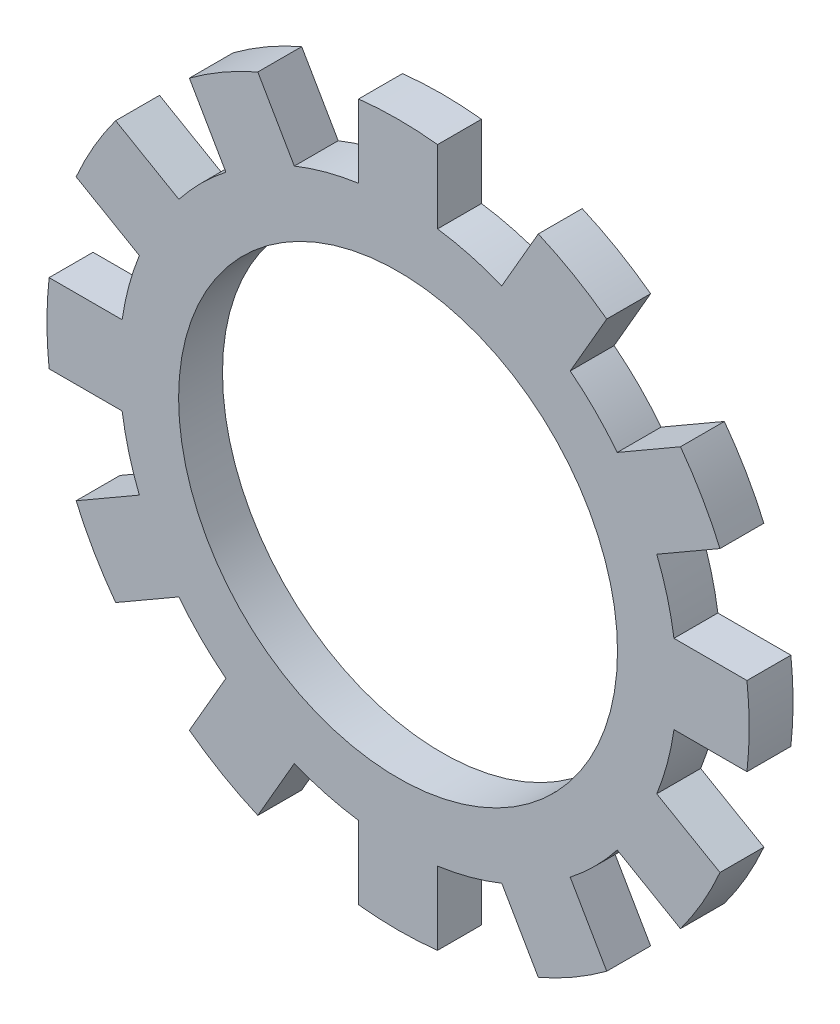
from build123d import *

# Parameters (mm, degrees)
SKETCH1_R                 = 3.175
SKETCH1_R_2               = 2.5
BOSS_EXTRUDE1_DEPTH       = 0.25
BOSS_EXTRUDE2_DEPTH       = 0.25
CIRPATTERN2_COUNT         = 12
CIRPATTERN2_COPY_1_DEPTH  = 0.25
CIRPATTERN2_COPY_2_DEPTH  = 0.25
CIRPATTERN2_COPY_3_DEPTH  = 0.25
CIRPATTERN2_COPY_4_DEPTH  = 0.25
CIRPATTERN2_COPY_5_DEPTH  = 0.25
CIRPATTERN2_COPY_6_DEPTH  = 0.25
CIRPATTERN2_COPY_7_DEPTH  = 0.25
CIRPATTERN2_COPY_8_DEPTH  = 0.25
CIRPATTERN2_COPY_9_DEPTH  = 0.25
CIRPATTERN2_COPY_10_DEPTH = 0.25
CIRPATTERN2_COPY_11_DEPTH = 0.25


with BuildPart() as part:
    # Sketch1 → Boss-Extrude1 (new, symmetric)
    with BuildSketch(Plane.XY):
        Circle(SKETCH1_R)
        Circle(SKETCH1_R_2, mode=Mode.SUBTRACT)
    extrude(amount=BOSS_EXTRUDE1_DEPTH, both=True)

    # Sketch3 → Boss-Extrude2 (add, symmetric)
    with BuildSketch(Plane.XY):
        with BuildLine():
            Line((-0.45, 3.974606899), (-0.45, 3.142948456))
            ThreePointArc((-0.45, 3.142948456), (-0.225570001, 3.166976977), (0, 3.175))
            Line((0, 3.175), (0, 4))
            ThreePointArc((0, 4), (-0.225357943, 3.993646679), (-0.45, 3.974606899))
        make_face()
    boss_extrude2 = extrude(amount=BOSS_EXTRUDE2_DEPTH, both=True)

    # Mirror1: Boss-Extrude2 across plane
    add(boss_extrude2.mirror(Plane(origin=(0, 0, 0), x_dir=(0, 0, 1), z_dir=(1, 0, 0))))

    # CirPattern2: Boss-Extrude2 ×12 about axis
    cirpattern2_axis = Axis((0, 0, 0), (0, 0, 1))
    for i in range(1, CIRPATTERN2_COUNT):
        add(boss_extrude2.rotate(cirpattern2_axis, i * 360 / CIRPATTERN2_COUNT))

    # CirPattern2 copy 1 sketch → CirPattern2 copy 1 (add, symmetric)
    with BuildSketch(Plane(origin=(0, 0, 0), x_dir=(-0.8660254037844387, -0.49999999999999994, 0), z_dir=(0, 0, 1))):
        with BuildLine():
            Line((-0.45, -3.974606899), (-0.45, -3.142948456))
            ThreePointArc((-0.45, -3.142948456), (-0.225570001, -3.166976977), (0, -3.175))
            Line((0, -3.175), (0, -4))
            ThreePointArc((0, -4), (-0.225357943, -3.993646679), (-0.45, -3.974606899))
        make_face()
    extrude(amount=CIRPATTERN2_COPY_1_DEPTH, both=True)

    # CirPattern2 copy 2 sketch → CirPattern2 copy 2 (add, symmetric)
    with BuildSketch(Plane(origin=(0, 0, 0), x_dir=(-0.5000000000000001, -0.8660254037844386, 0), z_dir=(0, 0, 1))):
        with BuildLine():
            Line((-0.45, -3.974606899), (-0.45, -3.142948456))
            ThreePointArc((-0.45, -3.142948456), (-0.225570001, -3.166976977), (0, -3.175))
            Line((0, -3.175), (0, -4))
            ThreePointArc((0, -4), (-0.225357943, -3.993646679), (-0.45, -3.974606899))
        make_face()
    extrude(amount=CIRPATTERN2_COPY_2_DEPTH, both=True)

    # CirPattern2 copy 3 sketch → CirPattern2 copy 3 (add, symmetric)
    with BuildSketch(Plane(origin=(0, 0, 0), x_dir=(0, -1, 0), z_dir=(0, 0, 1))):
        with BuildLine():
            Line((-0.45, -3.974606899), (-0.45, -3.142948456))
            ThreePointArc((-0.45, -3.142948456), (-0.225570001, -3.166976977), (0, -3.175))
            Line((0, -3.175), (0, -4))
            ThreePointArc((0, -4), (-0.225357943, -3.993646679), (-0.45, -3.974606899))
        make_face()
    extrude(amount=CIRPATTERN2_COPY_3_DEPTH, both=True)

    # CirPattern2 copy 4 sketch → CirPattern2 copy 4 (add, symmetric)
    with BuildSketch(Plane(origin=(0, 0, 0), x_dir=(0.4999999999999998, -0.8660254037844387, 0), z_dir=(0, 0, 1))):
        with BuildLine():
            Line((-0.45, -3.974606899), (-0.45, -3.142948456))
            ThreePointArc((-0.45, -3.142948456), (-0.225570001, -3.166976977), (0, -3.175))
            Line((0, -3.175), (0, -4))
            ThreePointArc((0, -4), (-0.225357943, -3.993646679), (-0.45, -3.974606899))
        make_face()
    extrude(amount=CIRPATTERN2_COPY_4_DEPTH, both=True)

    # CirPattern2 copy 5 sketch → CirPattern2 copy 5 (add, symmetric)
    with BuildSketch(Plane(origin=(0, 0, 0), x_dir=(0.8660254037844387, -0.49999999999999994, 0), z_dir=(0, 0, 1))):
        with BuildLine():
            Line((-0.45, -3.974606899), (-0.45, -3.142948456))
            ThreePointArc((-0.45, -3.142948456), (-0.225570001, -3.166976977), (0, -3.175))
            Line((0, -3.175), (0, -4))
            ThreePointArc((0, -4), (-0.225357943, -3.993646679), (-0.45, -3.974606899))
        make_face()
    extrude(amount=CIRPATTERN2_COPY_5_DEPTH, both=True)

    # CirPattern2 copy 6 sketch → CirPattern2 copy 6 (add, symmetric)
    with BuildSketch(Plane.XY):
        with BuildLine():
            Line((-0.45, -3.974606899), (-0.45, -3.142948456))
            ThreePointArc((-0.45, -3.142948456), (-0.225570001, -3.166976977), (0, -3.175))
            Line((0, -3.175), (0, -4))
            ThreePointArc((0, -4), (-0.225357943, -3.993646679), (-0.45, -3.974606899))
        make_face()
    extrude(amount=CIRPATTERN2_COPY_6_DEPTH, both=True)

    # CirPattern2 copy 7 sketch → CirPattern2 copy 7 (add, symmetric)
    with BuildSketch(Plane(origin=(0, 0, 0), x_dir=(0.8660254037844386, 0.5000000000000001, 0), z_dir=(0, 0, 1))):
        with BuildLine():
            Line((-0.45, -3.974606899), (-0.45, -3.142948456))
            ThreePointArc((-0.45, -3.142948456), (-0.225570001, -3.166976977), (0, -3.175))
            Line((0, -3.175), (0, -4))
            ThreePointArc((0, -4), (-0.225357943, -3.993646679), (-0.45, -3.974606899))
        make_face()
    extrude(amount=CIRPATTERN2_COPY_7_DEPTH, both=True)

    # CirPattern2 copy 8 sketch → CirPattern2 copy 8 (add, symmetric)
    with BuildSketch(Plane(origin=(0, 0, 0), x_dir=(0.5000000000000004, 0.8660254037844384, 0), z_dir=(0, 0, 1))):
        with BuildLine():
            Line((-0.45, -3.974606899), (-0.45, -3.142948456))
            ThreePointArc((-0.45, -3.142948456), (-0.225570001, -3.166976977), (0, -3.175))
            Line((0, -3.175), (0, -4))
            ThreePointArc((0, -4), (-0.225357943, -3.993646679), (-0.45, -3.974606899))
        make_face()
    extrude(amount=CIRPATTERN2_COPY_8_DEPTH, both=True)

    # CirPattern2 copy 9 sketch → CirPattern2 copy 9 (add, symmetric)
    with BuildSketch(Plane(origin=(0, 0, 0), x_dir=(0, 1, 0), z_dir=(0, 0, 1))):
        with BuildLine():
            Line((-0.45, -3.974606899), (-0.45, -3.142948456))
            ThreePointArc((-0.45, -3.142948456), (-0.225570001, -3.166976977), (0, -3.175))
            Line((0, -3.175), (0, -4))
            ThreePointArc((0, -4), (-0.225357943, -3.993646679), (-0.45, -3.974606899))
        make_face()
    extrude(amount=CIRPATTERN2_COPY_9_DEPTH, both=True)

    # CirPattern2 copy 10 sketch → CirPattern2 copy 10 (add, symmetric)
    with BuildSketch(Plane(origin=(0, 0, 0), x_dir=(-0.5000000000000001, 0.8660254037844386, 0), z_dir=(0, 0, 1))):
        with BuildLine():
            Line((-0.45, -3.974606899), (-0.45, -3.142948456))
            ThreePointArc((-0.45, -3.142948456), (-0.225570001, -3.166976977), (0, -3.175))
            Line((0, -3.175), (0, -4))
            ThreePointArc((0, -4), (-0.225357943, -3.993646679), (-0.45, -3.974606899))
        make_face()
    extrude(amount=CIRPATTERN2_COPY_10_DEPTH, both=True)

    # CirPattern2 copy 11 sketch → CirPattern2 copy 11 (add, symmetric)
    with BuildSketch(Plane(origin=(0, 0, 0), x_dir=(-0.8660254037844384, 0.5000000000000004, 0), z_dir=(0, 0, 1))):
        with BuildLine():
            Line((-0.45, -3.974606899), (-0.45, -3.142948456))
            ThreePointArc((-0.45, -3.142948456), (-0.225570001, -3.166976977), (0, -3.175))
            Line((0, -3.175), (0, -4))
            ThreePointArc((0, -4), (-0.225357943, -3.993646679), (-0.45, -3.974606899))
        make_face()
    extrude(amount=CIRPATTERN2_COPY_11_DEPTH, both=True)


solid = part.part
